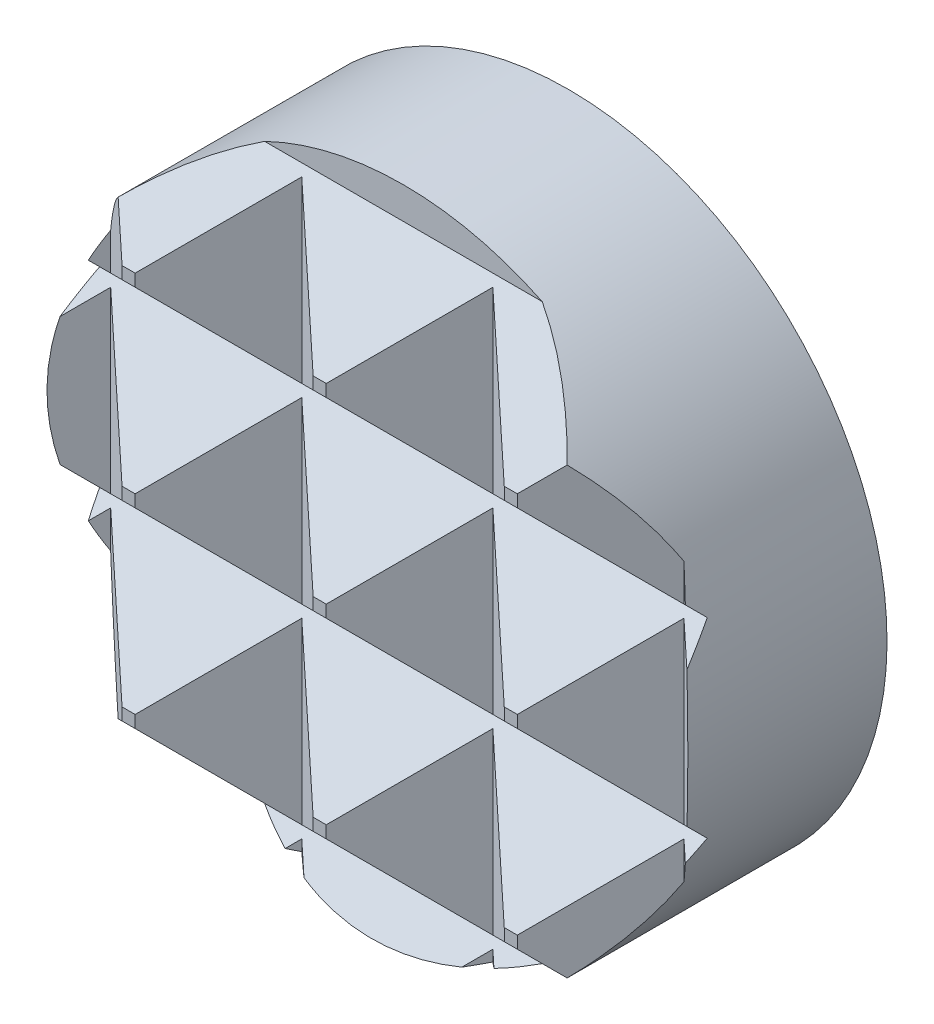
ISO-10303-21;
HEADER;
FILE_DESCRIPTION(('STEP AP214'),'2;1');
FILE_NAME('part.step','',(''),(''),'','','');
FILE_SCHEMA(('AUTOMOTIVE_DESIGN { 1 0 10303 214 1 1 1 1 }'));
ENDSEC;
DATA;
#1=APPLICATION_CONTEXT('core data for automotive mechanical design processes');
#2=APPLICATION_PROTOCOL_DEFINITION('international standard','automotive_design',2000,#1);
#3=PRODUCT_CONTEXT('',#1,'mechanical');
#4=PRODUCT('Part','Part','',(#3));
#5=PRODUCT_RELATED_PRODUCT_CATEGORY('part','',(#4));
#6=PRODUCT_DEFINITION_FORMATION('','',#4);
#7=PRODUCT_DEFINITION_CONTEXT('part definition',#1,'design');
#8=PRODUCT_DEFINITION('design','',#6,#7);
#9=PRODUCT_DEFINITION_SHAPE('','',#8);
#10=(LENGTH_UNIT() NAMED_UNIT(*) SI_UNIT(.MILLI.,.METRE.));
#11=(NAMED_UNIT(*) PLANE_ANGLE_UNIT() SI_UNIT($,.RADIAN.));
#12=(NAMED_UNIT(*) SI_UNIT($,.STERADIAN.) SOLID_ANGLE_UNIT());
#13=UNCERTAINTY_MEASURE_WITH_UNIT(LENGTH_MEASURE(1.E-05),#10,'distance_accuracy_value','');
#14=(GEOMETRIC_REPRESENTATION_CONTEXT(3) GLOBAL_UNCERTAINTY_ASSIGNED_CONTEXT((#13)) GLOBAL_UNIT_ASSIGNED_CONTEXT((#10,
#11,#12)) REPRESENTATION_CONTEXT('',''));
#15=CARTESIAN_POINT('',(0.,0.,0.));
#16=DIRECTION('',(0.,0.,1.));
#17=DIRECTION('',(1.,0.,0.));
#18=AXIS2_PLACEMENT_3D('',#15,#16,#17);
#19=CARTESIAN_POINT('',(3.96975,2.45745,3.679825));
#20=DIRECTION('',(0.,0.,-1.));
#21=DIRECTION('',(-1.,0.,0.));
#22=AXIS2_PLACEMENT_3D('',#19,#20,#21);
#23=PLANE('',#22);
#24=DIRECTION('',(-1.,0.,0.));
#25=VECTOR('',#24,1.);
#26=CARTESIAN_POINT('',(3.96975,2.30505,3.679825));
#27=LINE('',#26,#25);
#28=CARTESIAN_POINT('',(2.53365,2.30505,3.679825));
#29=VERTEX_POINT('',#28);
#30=CARTESIAN_POINT('',(2.37082948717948,2.30505,3.679825));
#31=VERTEX_POINT('',#30);
#32=EDGE_CURVE('E558',#29,#31,#27,.T.);
#33=ORIENTED_EDGE('',*,*,#32,.F.);
#34=DIRECTION('',(0.,1.,0.));
#35=VECTOR('',#34,1.);
#36=CARTESIAN_POINT('',(2.53365,2.45745,3.679825));
#37=LINE('',#36,#35);
#38=CARTESIAN_POINT('',(2.53365,2.45745,3.679825));
#39=VERTEX_POINT('',#38);
#40=EDGE_CURVE('E29',#29,#39,#37,.T.);
#41=ORIENTED_EDGE('',*,*,#40,.T.);
#42=DIRECTION('',(-1.,0.,0.));
#43=VECTOR('',#42,1.);
#44=CARTESIAN_POINT('',(3.96975,2.45745,3.679825));
#45=LINE('',#44,#43);
#46=CARTESIAN_POINT('',(2.37082948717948,2.45745,3.679825));
#47=VERTEX_POINT('',#46);
#48=EDGE_CURVE('E553',#39,#47,#45,.T.);
#49=ORIENTED_EDGE('',*,*,#48,.T.);
#50=DIRECTION('',(0.,-1.,0.));
#51=VECTOR('',#50,1.);
#52=CARTESIAN_POINT('',(2.37082948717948,2.45745,3.679825));
#53=LINE('',#52,#51);
#54=EDGE_CURVE('E395',#47,#31,#53,.T.);
#55=ORIENTED_EDGE('',*,*,#54,.T.);
#56=EDGE_LOOP('',(#33,#41,#49,#55));
#57=FACE_BOUND('',#56,.T.);
#58=ADVANCED_FACE('F14',(#57),#23,.F.);
#59=CARTESIAN_POINT('',(3.969775,0.0761999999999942,3.679825));
#60=DIRECTION('',(0.,0.,-1.));
#61=DIRECTION('',(-1.,0.,0.));
#62=AXIS2_PLACEMENT_3D('',#59,#60,#61);
#63=PLANE('',#62);
#64=DIRECTION('',(-1.,0.,0.));
#65=VECTOR('',#64,1.);
#66=CARTESIAN_POINT('',(3.969775,-0.0761999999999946,3.679825));
#67=LINE('',#66,#65);
#68=CARTESIAN_POINT('',(2.53365,-0.0761999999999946,3.679825));
#69=VERTEX_POINT('',#68);
#70=CARTESIAN_POINT('',(2.37082948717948,-0.0761999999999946,3.679825));
#71=VERTEX_POINT('',#70);
#72=EDGE_CURVE('E547',#69,#71,#67,.T.);
#73=ORIENTED_EDGE('',*,*,#72,.F.);
#74=DIRECTION('',(0.,1.,0.));
#75=VECTOR('',#74,1.);
#76=CARTESIAN_POINT('',(2.53365,0.0761999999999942,3.679825));
#77=LINE('',#76,#75);
#78=CARTESIAN_POINT('',(2.53365,0.0761999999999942,3.679825));
#79=VERTEX_POINT('',#78);
#80=EDGE_CURVE('E37',#69,#79,#77,.T.);
#81=ORIENTED_EDGE('',*,*,#80,.T.);
#82=DIRECTION('',(-1.,0.,0.));
#83=VECTOR('',#82,1.);
#84=CARTESIAN_POINT('',(3.969775,0.0761999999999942,3.679825));
#85=LINE('',#84,#83);
#86=CARTESIAN_POINT('',(2.37082948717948,0.0761999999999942,3.679825));
#87=VERTEX_POINT('',#86);
#88=EDGE_CURVE('E542',#79,#87,#85,.T.);
#89=ORIENTED_EDGE('',*,*,#88,.T.);
#90=DIRECTION('',(0.,-1.,0.));
#91=VECTOR('',#90,1.);
#92=CARTESIAN_POINT('',(2.37082948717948,0.0761999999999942,3.679825));
#93=LINE('',#92,#91);
#94=EDGE_CURVE('E386',#87,#71,#93,.T.);
#95=ORIENTED_EDGE('',*,*,#94,.T.);
#96=EDGE_LOOP('',(#73,#81,#89,#95));
#97=FACE_BOUND('',#96,.T.);
#98=ADVANCED_FACE('F704',(#97),#63,.F.);
#99=CARTESIAN_POINT('',(3.969775,-2.30505,3.679825));
#100=DIRECTION('',(0.,0.,-1.));
#101=DIRECTION('',(-1.,0.,0.));
#102=AXIS2_PLACEMENT_3D('',#99,#100,#101);
#103=PLANE('',#102);
#104=DIRECTION('',(-1.,0.,0.));
#105=VECTOR('',#104,1.);
#106=CARTESIAN_POINT('',(3.969775,-2.45745,3.679825));
#107=LINE('',#106,#105);
#108=CARTESIAN_POINT('',(2.53365,-2.45745,3.679825));
#109=VERTEX_POINT('',#108);
#110=CARTESIAN_POINT('',(2.37082948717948,-2.45745,3.679825));
#111=VERTEX_POINT('',#110);
#112=EDGE_CURVE('E521',#109,#111,#107,.T.);
#113=ORIENTED_EDGE('',*,*,#112,.F.);
#114=DIRECTION('',(0.,1.,0.));
#115=VECTOR('',#114,1.);
#116=CARTESIAN_POINT('',(2.53365,-2.30505,3.679825));
#117=LINE('',#116,#115);
#118=CARTESIAN_POINT('',(2.53365,-2.30505,3.679825));
#119=VERTEX_POINT('',#118);
#120=EDGE_CURVE('E304',#109,#119,#117,.T.);
#121=ORIENTED_EDGE('',*,*,#120,.T.);
#122=DIRECTION('',(-1.,0.,0.));
#123=VECTOR('',#122,1.);
#124=CARTESIAN_POINT('',(3.969775,-2.30505,3.679825));
#125=LINE('',#124,#123);
#126=CARTESIAN_POINT('',(2.37082948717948,-2.30505,3.679825));
#127=VERTEX_POINT('',#126);
#128=EDGE_CURVE('E525',#119,#127,#125,.T.);
#129=ORIENTED_EDGE('',*,*,#128,.T.);
#130=DIRECTION('',(0.,-1.,0.));
#131=VECTOR('',#130,1.);
#132=CARTESIAN_POINT('',(2.37082948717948,-2.30505,3.679825));
#133=LINE('',#132,#131);
#134=EDGE_CURVE('E377',#127,#111,#133,.T.);
#135=ORIENTED_EDGE('',*,*,#134,.T.);
#136=EDGE_LOOP('',(#113,#121,#129,#135));
#137=FACE_BOUND('',#136,.T.);
#138=ADVANCED_FACE('F614',(#137),#103,.F.);
#139=CARTESIAN_POINT('',(0.1524,2.30505,3.679825));
#140=VERTEX_POINT('',#139);
#141=CARTESIAN_POINT('',(-0.0104205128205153,2.30505,3.679825));
#142=VERTEX_POINT('',#141);
#143=EDGE_CURVE('E561',#140,#142,#27,.T.);
#144=ORIENTED_EDGE('',*,*,#143,.F.);
#145=DIRECTION('',(0.,1.,0.));
#146=VECTOR('',#145,1.);
#147=CARTESIAN_POINT('',(0.1524,2.45745,3.679825));
#148=LINE('',#147,#146);
#149=CARTESIAN_POINT('',(0.1524,2.45745,3.679825));
#150=VERTEX_POINT('',#149);
#151=EDGE_CURVE('E366',#140,#150,#148,.T.);
#152=ORIENTED_EDGE('',*,*,#151,.T.);
#153=CARTESIAN_POINT('',(-0.010420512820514,2.45745,3.679825));
#154=VERTEX_POINT('',#153);
#155=EDGE_CURVE('E556',#150,#154,#45,.T.);
#156=ORIENTED_EDGE('',*,*,#155,.T.);
#157=DIRECTION('',(0.,-1.,0.));
#158=VECTOR('',#157,1.);
#159=CARTESIAN_POINT('',(-0.010420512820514,2.45745,3.679825));
#160=LINE('',#159,#158);
#161=EDGE_CURVE('E459',#154,#142,#160,.T.);
#162=ORIENTED_EDGE('',*,*,#161,.T.);
#163=EDGE_LOOP('',(#144,#152,#156,#162));
#164=FACE_BOUND('',#163,.T.);
#165=ADVANCED_FACE('F717',(#164),#23,.F.);
#166=CARTESIAN_POINT('',(0.1524,-0.0761999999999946,3.679825));
#167=VERTEX_POINT('',#166);
#168=CARTESIAN_POINT('',(-0.0104205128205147,-0.0761999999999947,3.679825));
#169=VERTEX_POINT('',#168);
#170=EDGE_CURVE('E549',#167,#169,#67,.T.);
#171=ORIENTED_EDGE('',*,*,#170,.F.);
#172=DIRECTION('',(0.,1.,0.));
#173=VECTOR('',#172,1.);
#174=CARTESIAN_POINT('',(0.1524,0.0761999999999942,3.679825));
#175=LINE('',#174,#173);
#176=CARTESIAN_POINT('',(0.1524,0.0761999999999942,3.679825));
#177=VERTEX_POINT('',#176);
#178=EDGE_CURVE('E357',#167,#177,#175,.T.);
#179=ORIENTED_EDGE('',*,*,#178,.T.);
#180=CARTESIAN_POINT('',(-0.0104205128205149,0.0761999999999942,3.679825));
#181=VERTEX_POINT('',#180);
#182=EDGE_CURVE('E545',#177,#181,#85,.T.);
#183=ORIENTED_EDGE('',*,*,#182,.T.);
#184=DIRECTION('',(0.,-1.,0.));
#185=VECTOR('',#184,1.);
#186=CARTESIAN_POINT('',(-0.0104205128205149,0.0761999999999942,3.679825));
#187=LINE('',#186,#185);
#188=EDGE_CURVE('E450',#181,#169,#187,.T.);
#189=ORIENTED_EDGE('',*,*,#188,.T.);
#190=EDGE_LOOP('',(#171,#179,#183,#189));
#191=FACE_BOUND('',#190,.T.);
#192=ADVANCED_FACE('F693',(#191),#63,.F.);
#193=CARTESIAN_POINT('',(0.1524,-2.45745,3.679825));
#194=VERTEX_POINT('',#193);
#195=CARTESIAN_POINT('',(-0.0104205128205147,-2.45745,3.679825));
#196=VERTEX_POINT('',#195);
#197=EDGE_CURVE('E524',#194,#196,#107,.T.);
#198=ORIENTED_EDGE('',*,*,#197,.F.);
#199=DIRECTION('',(0.,1.,0.));
#200=VECTOR('',#199,1.);
#201=CARTESIAN_POINT('',(0.1524,-2.30505,3.679825));
#202=LINE('',#201,#200);
#203=CARTESIAN_POINT('',(0.1524,-2.30505,3.679825));
#204=VERTEX_POINT('',#203);
#205=EDGE_CURVE('E348',#194,#204,#202,.T.);
#206=ORIENTED_EDGE('',*,*,#205,.T.);
#207=CARTESIAN_POINT('',(-0.0104205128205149,-2.30505,3.679825));
#208=VERTEX_POINT('',#207);
#209=EDGE_CURVE('E527',#204,#208,#125,.T.);
#210=ORIENTED_EDGE('',*,*,#209,.T.);
#211=DIRECTION('',(0.,-1.,0.));
#212=VECTOR('',#211,1.);
#213=CARTESIAN_POINT('',(-0.0104205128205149,-2.30505,3.679825));
#214=LINE('',#213,#212);
#215=EDGE_CURVE('E441',#208,#196,#214,.T.);
#216=ORIENTED_EDGE('',*,*,#215,.T.);
#217=EDGE_LOOP('',(#198,#206,#210,#216));
#218=FACE_BOUND('',#217,.T.);
#219=ADVANCED_FACE('F629',(#218),#103,.F.);
#220=CARTESIAN_POINT('',(0.,0.,0.));
#221=DIRECTION('',(0.,0.,1.));
#222=DIRECTION('',(1.,0.,0.));
#223=AXIS2_PLACEMENT_3D('',#220,#221,#222);
#224=CYLINDRICAL_SURFACE('',#223,3.96875);
#225=CARTESIAN_POINT('',(0.,0.,-0.5005757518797));
#226=DIRECTION('',(0.660500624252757,0.,-0.750825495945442));
#227=DIRECTION('',(0.750825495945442,0.,0.660500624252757));
#228=AXIS2_PLACEMENT_3D('',#225,#226,#227);
#229=ELLIPSE('',#228,5.28584873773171,3.96875);
#230=CARTESIAN_POINT('',(3.87765746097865,-0.845428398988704,2.91059660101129));
#231=VERTEX_POINT('',#230);
#232=CARTESIAN_POINT('',(3.87765746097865,0.845428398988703,2.91059660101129));
#233=VERTEX_POINT('',#232);
#234=EDGE_CURVE('E321',#231,#233,#229,.F.);
#235=ORIENTED_EDGE('',*,*,#234,.F.);
#236=CARTESIAN_POINT('',(0.,0.,3.756025));
#237=DIRECTION('',(0.,0.707106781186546,-0.70710678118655));
#238=DIRECTION('',(0.,0.70710678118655,0.707106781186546));
#239=AXIS2_PLACEMENT_3D('',#236,#237,#238);
#240=ELLIPSE('',#239,5.61266007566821,3.96875);
#241=CARTESIAN_POINT('',(3.78594620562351,-1.190625,2.5654));
#242=VERTEX_POINT('',#241);
#243=EDGE_CURVE('E538',#231,#242,#240,.T.);
#244=ORIENTED_EDGE('',*,*,#243,.T.);
#245=CARTESIAN_POINT('',(0.,0.,1.374775));
#246=DIRECTION('',(0.,-0.707106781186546,-0.70710678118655));
#247=DIRECTION('',(0.,-0.70710678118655,0.707106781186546));
#248=AXIS2_PLACEMENT_3D('',#245,#246,#247);
#249=ELLIPSE('',#248,5.61266007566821,3.96875);
#250=CARTESIAN_POINT('',(3.71601690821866,-1.39362652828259,2.76840152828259));
#251=VERTEX_POINT('',#250);
#252=EDGE_CURVE('E317',#242,#251,#249,.T.);
#253=ORIENTED_EDGE('',*,*,#252,.T.);
#254=CARTESIAN_POINT('',(3.571875,-1.7299380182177,2.6416));
#255=VERTEX_POINT('',#254);
#256=EDGE_CURVE('E309',#255,#251,#229,.F.);
#257=ORIENTED_EDGE('',*,*,#256,.F.);
#258=CARTESIAN_POINT('',(0.,0.,6.213475));
#259=DIRECTION('',(-0.707106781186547,0.,-0.707106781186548));
#260=DIRECTION('',(-0.707106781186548,0.,0.707106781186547));
#261=AXIS2_PLACEMENT_3D('',#258,#259,#260);
#262=ELLIPSE('',#261,5.61266007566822,3.96875);
#263=CARTESIAN_POINT('',(2.844171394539,-2.76797139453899,3.369303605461));
#264=VERTEX_POINT('',#263);
#265=EDGE_CURVE('E295',#264,#255,#262,.F.);
#266=ORIENTED_EDGE('',*,*,#265,.F.);
#267=CARTESIAN_POINT('',(0.,0.,6.137275));
#268=DIRECTION('',(0.,0.707106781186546,-0.70710678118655));
#269=DIRECTION('',(0.,0.70710678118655,0.707106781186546));
#270=AXIS2_PLACEMENT_3D('',#267,#268,#269);
#271=ELLIPSE('',#270,5.61266007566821,3.96875);
#272=CARTESIAN_POINT('',(1.72993801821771,-3.571875,2.5654));
#273=VERTEX_POINT('',#272);
#274=EDGE_CURVE('E528',#264,#273,#271,.T.);
#275=ORIENTED_EDGE('',*,*,#274,.T.);
#276=CARTESIAN_POINT('',(0.,0.,-1.006475));
#277=DIRECTION('',(0.,-0.707106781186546,-0.70710678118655));
#278=DIRECTION('',(0.,-0.70710678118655,0.707106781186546));
#279=AXIS2_PLACEMENT_3D('',#276,#277,#278);
#280=ELLIPSE('',#279,5.6126600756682,3.96875);
#281=CARTESIAN_POINT('',(1.30448615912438,-3.74823857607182,2.74176357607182));
#282=VERTEX_POINT('',#281);
#283=EDGE_CURVE('E510',#273,#282,#280,.T.);
#284=ORIENTED_EDGE('',*,*,#283,.T.);
#285=CARTESIAN_POINT('',(0.,0.,1.59420808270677));
#286=DIRECTION('',(0.660500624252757,0.,-0.750825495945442));
#287=DIRECTION('',(0.750825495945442,0.,0.660500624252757));
#288=AXIS2_PLACEMENT_3D('',#285,#286,#287);
#289=ELLIPSE('',#288,5.28584873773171,3.96875);
#290=CARTESIAN_POINT('',(1.190625,-3.78594620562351,2.6416));
#291=VERTEX_POINT('',#290);
#292=EDGE_CURVE('E372',#291,#282,#289,.F.);
#293=ORIENTED_EDGE('',*,*,#292,.F.);
#294=CARTESIAN_POINT('',(0.,0.,3.832225));
#295=DIRECTION('',(-0.707106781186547,0.,-0.707106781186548));
#296=DIRECTION('',(-0.707106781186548,0.,0.707106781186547));
#297=AXIS2_PLACEMENT_3D('',#294,#295,#296);
#298=ELLIPSE('',#297,5.61266007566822,3.96875);
#299=CARTESIAN_POINT('',(0.997297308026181,-3.84140269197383,2.83492769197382));
#300=VERTEX_POINT('',#299);
#301=EDGE_CURVE('E343',#300,#291,#298,.F.);
#302=ORIENTED_EDGE('',*,*,#301,.F.);
#303=CARTESIAN_POINT('',(-0.9600994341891,-3.85086816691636,2.84439316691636));
#304=VERTEX_POINT('',#303);
#305=EDGE_CURVE('E514',#300,#304,#280,.T.);
#306=ORIENTED_EDGE('',*,*,#305,.T.);
#307=CARTESIAN_POINT('',(0.,0.,3.68899191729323));
#308=DIRECTION('',(0.660500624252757,0.,-0.750825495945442));
#309=DIRECTION('',(0.750825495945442,0.,0.660500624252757));
#310=AXIS2_PLACEMENT_3D('',#307,#308,#309);
#311=ELLIPSE('',#310,5.28584873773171,3.96875);
#312=CARTESIAN_POINT('',(-1.190625,-3.78594620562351,2.6416));
#313=VERTEX_POINT('',#312);
#314=EDGE_CURVE('E435',#313,#304,#311,.F.);
#315=ORIENTED_EDGE('',*,*,#314,.F.);
#316=CARTESIAN_POINT('',(0.,0.,1.450975));
#317=DIRECTION('',(-0.707106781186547,0.,-0.707106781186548));
#318=DIRECTION('',(-0.707106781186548,0.,0.707106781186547));
#319=AXIS2_PLACEMENT_3D('',#316,#317,#318);
#320=ELLIPSE('',#319,5.61266007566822,3.96875);
#321=CARTESIAN_POINT('',(-1.29431347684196,-3.75176347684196,2.74528847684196));
#322=VERTEX_POINT('',#321);
#323=EDGE_CURVE('E406',#322,#313,#320,.F.);
#324=ORIENTED_EDGE('',*,*,#323,.F.);
#325=CARTESIAN_POINT('',(-1.72993801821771,-3.571875,2.5654));
#326=VERTEX_POINT('',#325);
#327=EDGE_CURVE('E515',#322,#326,#280,.T.);
#328=ORIENTED_EDGE('',*,*,#327,.T.);
#329=CARTESIAN_POINT('',(0.,0.,6.137275));
#330=DIRECTION('',(0.,-0.707106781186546,0.70710678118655));
#331=DIRECTION('',(0.,0.70710678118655,0.707106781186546));
#332=AXIS2_PLACEMENT_3D('',#329,#330,#331);
#333=ELLIPSE('',#332,5.61266007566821,3.96875);
#334=CARTESIAN_POINT('',(-2.79786000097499,-2.81477458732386,3.32250041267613));
#335=VERTEX_POINT('',#334);
#336=EDGE_CURVE('E523',#335,#326,#333,.T.);
#337=ORIENTED_EDGE('',*,*,#336,.F.);
#338=CARTESIAN_POINT('',(0.,0.,5.7837757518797));
#339=DIRECTION('',(0.660500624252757,0.,-0.750825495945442));
#340=DIRECTION('',(0.750825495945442,0.,0.660500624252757));
#341=AXIS2_PLACEMENT_3D('',#338,#339,#340);
#342=ELLIPSE('',#341,5.28584873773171,3.96875);
#343=CARTESIAN_POINT('',(-3.571875,-1.72993801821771,2.6416));
#344=VERTEX_POINT('',#343);
#345=EDGE_CURVE('E473',#344,#335,#342,.F.);
#346=ORIENTED_EDGE('',*,*,#345,.F.);
#347=CARTESIAN_POINT('',(0.,0.,-0.930275));
#348=DIRECTION('',(-0.707106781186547,0.,-0.707106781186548));
#349=DIRECTION('',(-0.707106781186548,0.,0.707106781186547));
#350=AXIS2_PLACEMENT_3D('',#347,#348,#349);
#351=ELLIPSE('',#350,5.61266007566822,3.96875);
#352=CARTESIAN_POINT('',(-3.7112696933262,-1.4062196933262,2.7809946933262));
#353=VERTEX_POINT('',#352);
#354=EDGE_CURVE('E497',#353,#344,#351,.F.);
#355=ORIENTED_EDGE('',*,*,#354,.F.);
#356=CARTESIAN_POINT('',(0.,0.,1.374775));
#357=DIRECTION('',(0.,0.707106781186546,0.70710678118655));
#358=DIRECTION('',(0.,-0.70710678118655,0.707106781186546));
#359=AXIS2_PLACEMENT_3D('',#356,#357,#358);
#360=ELLIPSE('',#359,5.61266007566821,3.96875);
#361=CARTESIAN_POINT('',(-3.78594620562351,-1.190625,2.5654));
#362=VERTEX_POINT('',#361);
#363=EDGE_CURVE('E520',#362,#353,#360,.T.);
#364=ORIENTED_EDGE('',*,*,#363,.F.);
#365=CARTESIAN_POINT('',(0.,0.,3.756025));
#366=DIRECTION('',(0.,-0.707106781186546,0.70710678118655));
#367=DIRECTION('',(0.,0.70710678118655,0.707106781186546));
#368=AXIS2_PLACEMENT_3D('',#365,#366,#367);
#369=ELLIPSE('',#368,5.61266007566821,3.96875);
#370=CARTESIAN_POINT('',(-3.88753866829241,-0.798761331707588,2.95726366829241));
#371=VERTEX_POINT('',#370);
#372=EDGE_CURVE('E530',#371,#362,#369,.T.);
#373=ORIENTED_EDGE('',*,*,#372,.F.);
#374=CARTESIAN_POINT('',(-3.88753866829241,0.798761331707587,2.95726366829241));
#375=VERTEX_POINT('',#374);
#376=EDGE_CURVE('E501',#375,#371,#351,.F.);
#377=ORIENTED_EDGE('',*,*,#376,.F.);
#378=CARTESIAN_POINT('',(0.,0.,3.756025));
#379=DIRECTION('',(0.,0.707106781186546,0.70710678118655));
#380=DIRECTION('',(0.,-0.70710678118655,0.707106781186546));
#381=AXIS2_PLACEMENT_3D('',#378,#379,#380);
#382=ELLIPSE('',#381,5.61266007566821,3.96875);
#383=CARTESIAN_POINT('',(-3.78594620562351,1.190625,2.5654));
#384=VERTEX_POINT('',#383);
#385=EDGE_CURVE('E537',#384,#375,#382,.T.);
#386=ORIENTED_EDGE('',*,*,#385,.F.);
#387=CARTESIAN_POINT('',(0.,0.,1.374775));
#388=DIRECTION('',(0.,-0.707106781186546,0.707106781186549));
#389=DIRECTION('',(0.,0.70710678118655,0.707106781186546));
#390=AXIS2_PLACEMENT_3D('',#387,#388,#389);
#391=ELLIPSE('',#390,5.61266007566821,3.96875);
#392=CARTESIAN_POINT('',(-3.7112696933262,1.4062196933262,2.78099469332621));
#393=VERTEX_POINT('',#392);
#394=EDGE_CURVE('E540',#393,#384,#391,.T.);
#395=ORIENTED_EDGE('',*,*,#394,.F.);
#396=CARTESIAN_POINT('',(-3.571875,1.72993801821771,2.6416));
#397=VERTEX_POINT('',#396);
#398=EDGE_CURVE('E500',#397,#393,#351,.F.);
#399=ORIENTED_EDGE('',*,*,#398,.F.);
#400=CARTESIAN_POINT('',(-2.79786000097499,2.81477458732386,3.32250041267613));
#401=VERTEX_POINT('',#400);
#402=EDGE_CURVE('E476',#401,#397,#342,.F.);
#403=ORIENTED_EDGE('',*,*,#402,.F.);
#404=CARTESIAN_POINT('',(0.,0.,6.137275));
#405=DIRECTION('',(0.,0.707106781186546,0.70710678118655));
#406=DIRECTION('',(0.,-0.70710678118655,0.707106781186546));
#407=AXIS2_PLACEMENT_3D('',#404,#405,#406);
#408=ELLIPSE('',#407,5.61266007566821,3.96875);
#409=CARTESIAN_POINT('',(-1.72993801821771,3.571875,2.5654));
#410=VERTEX_POINT('',#409);
#411=EDGE_CURVE('E581',#410,#401,#408,.T.);
#412=ORIENTED_EDGE('',*,*,#411,.F.);
#413=CARTESIAN_POINT('',(0.,0.,2.5654));
#414=DIRECTION('',(0.,0.,1.));
#415=DIRECTION('',(1.,0.,0.));
#416=AXIS2_PLACEMENT_3D('',#413,#414,#415);
#417=CIRCLE('',#416,3.96875);
#418=CARTESIAN_POINT('',(1.72993801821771,3.571875,2.5654));
#419=VERTEX_POINT('',#418);
#420=EDGE_CURVE('E575',#419,#410,#417,.T.);
#421=ORIENTED_EDGE('',*,*,#420,.F.);
#422=CARTESIAN_POINT('',(0.,0.,6.137275));
#423=DIRECTION('',(0.,-0.707106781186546,-0.70710678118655));
#424=DIRECTION('',(0.,-0.70710678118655,0.707106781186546));
#425=AXIS2_PLACEMENT_3D('',#422,#423,#424);
#426=ELLIPSE('',#425,5.61266007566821,3.96875);
#427=CARTESIAN_POINT('',(2.844171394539,2.76797139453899,3.369303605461));
#428=VERTEX_POINT('',#427);
#429=EDGE_CURVE('E565',#419,#428,#426,.T.);
#430=ORIENTED_EDGE('',*,*,#429,.T.);
#431=CARTESIAN_POINT('',(3.571875,1.7299380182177,2.6416));
#432=VERTEX_POINT('',#431);
#433=EDGE_CURVE('E306',#432,#428,#262,.F.);
#434=ORIENTED_EDGE('',*,*,#433,.F.);
#435=CARTESIAN_POINT('',(3.71601690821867,1.39362652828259,2.76840152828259));
#436=VERTEX_POINT('',#435);
#437=EDGE_CURVE('E320',#436,#432,#229,.F.);
#438=ORIENTED_EDGE('',*,*,#437,.F.);
#439=CARTESIAN_POINT('',(0.,0.,1.374775));
#440=DIRECTION('',(0.,0.707106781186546,-0.707106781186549));
#441=DIRECTION('',(0.,0.70710678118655,0.707106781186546));
#442=AXIS2_PLACEMENT_3D('',#439,#440,#441);
#443=ELLIPSE('',#442,5.61266007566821,3.96875);
#444=CARTESIAN_POINT('',(3.78594620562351,1.190625,2.5654));
#445=VERTEX_POINT('',#444);
#446=EDGE_CURVE('E572',#436,#445,#443,.T.);
#447=ORIENTED_EDGE('',*,*,#446,.T.);
#448=CARTESIAN_POINT('',(0.,0.,3.756025));
#449=DIRECTION('',(0.,-0.707106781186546,-0.70710678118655));
#450=DIRECTION('',(0.,-0.70710678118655,0.707106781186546));
#451=AXIS2_PLACEMENT_3D('',#448,#449,#450);
#452=ELLIPSE('',#451,5.61266007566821,3.96875);
#453=EDGE_CURVE('E541',#445,#233,#452,.T.);
#454=ORIENTED_EDGE('',*,*,#453,.T.);
#455=EDGE_LOOP('',(#235,#244,#253,#257,#266,#275,#284,#293,#302,#306,#315,#324,#328,#337,#346,
#355,#364,#373,#377,#386,#395,#399,#403,#412,#421,#430,#434,#438,#447,#454));
#456=FACE_BOUND('',#455,.T.);
#457=CARTESIAN_POINT('',(0.,0.,0.508));
#458=DIRECTION('',(0.,0.,-1.));
#459=DIRECTION('',(-1.,0.,0.));
#460=AXIS2_PLACEMENT_3D('',#457,#458,#459);
#461=CIRCLE('',#460,3.96875);
#462=CARTESIAN_POINT('',(-3.96875,0.,0.508));
#463=VERTEX_POINT('',#462);
#464=EDGE_CURVE('E571',#463,#463,#461,.T.);
#465=ORIENTED_EDGE('',*,*,#464,.F.);
#466=EDGE_LOOP('',(#465));
#467=FACE_BOUND('',#466,.T.);
#468=ADVANCED_FACE('F16',(#456,#467),#224,.T.);
#469=CARTESIAN_POINT('',(0.,0.,2.5654));
#470=DIRECTION('',(0.,0.,1.));
#471=DIRECTION('',(1.,0.,0.));
#472=AXIS2_PLACEMENT_3D('',#469,#470,#471);
#473=PLANE('',#472);
#474=DIRECTION('',(-1.,0.,0.));
#475=VECTOR('',#474,1.);
#476=CARTESIAN_POINT('',(3.96975,3.571875,2.5654));
#477=LINE('',#476,#475);
#478=EDGE_CURVE('E555',#419,#410,#477,.T.);
#479=ORIENTED_EDGE('',*,*,#478,.F.);
#480=ORIENTED_EDGE('',*,*,#420,.T.);
#481=EDGE_LOOP('',(#479,#480));
#482=FACE_BOUND('',#481,.T.);
#483=ADVANCED_FACE('F1083',(#482),#473,.T.);
#484=CARTESIAN_POINT('',(0.,0.,0.508));
#485=DIRECTION('',(0.,0.,-1.));
#486=DIRECTION('',(-1.,0.,0.));
#487=AXIS2_PLACEMENT_3D('',#484,#485,#486);
#488=PLANE('',#487);
#489=CARTESIAN_POINT('',(0.,0.,0.508));
#490=DIRECTION('',(0.,0.,-1.));
#491=DIRECTION('',(-1.,0.,0.));
#492=AXIS2_PLACEMENT_3D('',#489,#490,#491);
#493=CIRCLE('',#492,3.71475);
#494=CARTESIAN_POINT('',(-3.71475,0.,0.508));
#495=VERTEX_POINT('',#494);
#496=EDGE_CURVE('E568',#495,#495,#493,.T.);
#497=ORIENTED_EDGE('',*,*,#496,.F.);
#498=EDGE_LOOP('',(#497));
#499=FACE_BOUND('',#498,.T.);
#500=ORIENTED_EDGE('',*,*,#464,.T.);
#501=EDGE_LOOP('',(#500));
#502=FACE_BOUND('',#501,.T.);
#503=ADVANCED_FACE('F1075',(#499,#502),#488,.T.);
#504=CARTESIAN_POINT('',(0.,0.,0.));
#505=DIRECTION('',(0.,0.,1.));
#506=DIRECTION('',(1.,0.,0.));
#507=AXIS2_PLACEMENT_3D('',#504,#505,#506);
#508=PLANE('',#507);
#509=CARTESIAN_POINT('',(0.,0.,0.));
#510=DIRECTION('',(0.,0.,1.));
#511=DIRECTION('',(1.,0.,0.));
#512=AXIS2_PLACEMENT_3D('',#509,#510,#511);
#513=CIRCLE('',#512,3.20675);
#514=CARTESIAN_POINT('',(3.20675,0.,0.));
#515=VERTEX_POINT('',#514);
#516=EDGE_CURVE('E576',#515,#515,#513,.F.);
#517=ORIENTED_EDGE('',*,*,#516,.T.);
#518=EDGE_LOOP('',(#517));
#519=FACE_BOUND('',#518,.T.);
#520=ADVANCED_FACE('F737',(#519),#508,.F.);
#521=CARTESIAN_POINT('',(0.,0.,0.));
#522=DIRECTION('',(0.,0.,1.));
#523=DIRECTION('',(1.,0.,0.));
#524=AXIS2_PLACEMENT_3D('',#521,#522,#523);
#525=CONICAL_SURFACE('',#524,3.20675,0.785398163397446);
#526=ORIENTED_EDGE('',*,*,#496,.T.);
#527=EDGE_LOOP('',(#526));
#528=FACE_BOUND('',#527,.T.);
#529=ORIENTED_EDGE('',*,*,#516,.F.);
#530=EDGE_LOOP('',(#529));
#531=FACE_BOUND('',#530,.T.);
#532=ADVANCED_FACE('F730',(#528,#531),#525,.T.);
#533=CARTESIAN_POINT('',(-2.22885,2.30505,3.679825));
#534=VERTEX_POINT('',#533);
#535=CARTESIAN_POINT('',(-2.39167051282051,2.30505,3.679825));
#536=VERTEX_POINT('',#535);
#537=EDGE_CURVE('E562',#534,#536,#27,.T.);
#538=ORIENTED_EDGE('',*,*,#537,.F.);
#539=DIRECTION('',(0.,1.,0.));
#540=VECTOR('',#539,1.);
#541=CARTESIAN_POINT('',(-2.22885,2.45745,3.679825));
#542=LINE('',#541,#540);
#543=CARTESIAN_POINT('',(-2.22885,2.45745,3.679825));
#544=VERTEX_POINT('',#543);
#545=EDGE_CURVE('E429',#534,#544,#542,.T.);
#546=ORIENTED_EDGE('',*,*,#545,.T.);
#547=CARTESIAN_POINT('',(-2.39167051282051,2.45745,3.679825));
#548=VERTEX_POINT('',#547);
#549=EDGE_CURVE('E557',#544,#548,#45,.T.);
#550=ORIENTED_EDGE('',*,*,#549,.T.);
#551=DIRECTION('',(0.,-1.,0.));
#552=VECTOR('',#551,1.);
#553=CARTESIAN_POINT('',(-2.39167051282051,2.45745,3.679825));
#554=LINE('',#553,#552);
#555=EDGE_CURVE('E491',#548,#536,#554,.T.);
#556=ORIENTED_EDGE('',*,*,#555,.T.);
#557=EDGE_LOOP('',(#538,#546,#550,#556));
#558=FACE_BOUND('',#557,.T.);
#559=ADVANCED_FACE('F721',(#558),#23,.F.);
#560=CARTESIAN_POINT('',(3.96975,3.571875,2.5654));
#561=DIRECTION('',(0.,-0.707106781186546,-0.70710678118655));
#562=DIRECTION('',(0.,0.70710678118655,-0.707106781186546));
#563=AXIS2_PLACEMENT_3D('',#560,#561,#562);
#564=PLANE('',#563);
#565=ORIENTED_EDGE('',*,*,#48,.F.);
#566=DIRECTION('',(0.577350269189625,0.577350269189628,-0.577350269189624));
#567=VECTOR('',#566,1.);
#568=CARTESIAN_POINT('',(3.7553,3.6791,2.458175));
#569=LINE('',#568,#567);
#570=EDGE_CURVE('E324',#39,#428,#569,.T.);
#571=ORIENTED_EDGE('',*,*,#570,.T.);
#572=ORIENTED_EDGE('',*,*,#429,.F.);
#573=ORIENTED_EDGE('',*,*,#478,.T.);
#574=ORIENTED_EDGE('',*,*,#411,.T.);
#575=DIRECTION('',(0.626501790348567,-0.55113315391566,0.551133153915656));
#576=VECTOR('',#575,1.);
#577=CARTESIAN_POINT('',(-0.664374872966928,0.937949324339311,5.19932567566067));
#578=LINE('',#577,#576);
#579=EDGE_CURVE('E488',#401,#548,#578,.T.);
#580=ORIENTED_EDGE('',*,*,#579,.T.);
#581=ORIENTED_EDGE('',*,*,#549,.F.);
#582=DIRECTION('',(0.577350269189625,0.577350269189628,-0.577350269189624));
#583=VECTOR('',#582,1.);
#584=CARTESIAN_POINT('',(0.5803,5.2666,0.870675));
#585=LINE('',#584,#583);
#586=CARTESIAN_POINT('',(-1.190625,3.495675,2.6416));
#587=VERTEX_POINT('',#586);
#588=EDGE_CURVE('E432',#544,#587,#585,.T.);
#589=ORIENTED_EDGE('',*,*,#588,.T.);
#590=DIRECTION('',(0.626501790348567,-0.55113315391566,0.551133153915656));
#591=VECTOR('',#590,1.);
#592=CARTESIAN_POINT('',(0.782223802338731,1.76016139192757,4.37711360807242));
#593=LINE('',#592,#591);
#594=EDGE_CURVE('E462',#587,#154,#593,.T.);
#595=ORIENTED_EDGE('',*,*,#594,.T.);
#596=ORIENTED_EDGE('',*,*,#155,.F.);
#597=DIRECTION('',(0.577350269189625,0.577350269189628,-0.577350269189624));
#598=VECTOR('',#597,1.);
#599=CARTESIAN_POINT('',(2.1678,4.47285,1.664425));
#600=LINE('',#599,#598);
#601=CARTESIAN_POINT('',(1.190625,3.495675,2.6416));
#602=VERTEX_POINT('',#601);
#603=EDGE_CURVE('E369',#150,#602,#600,.T.);
#604=ORIENTED_EDGE('',*,*,#603,.T.);
#605=DIRECTION('',(0.626501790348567,-0.55113315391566,0.551133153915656));
#606=VECTOR('',#605,1.);
#607=CARTESIAN_POINT('',(2.22882247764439,2.58237345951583,3.55490154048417));
#608=LINE('',#607,#606);
#609=EDGE_CURVE('E398',#602,#47,#608,.T.);
#610=ORIENTED_EDGE('',*,*,#609,.T.);
#611=EDGE_LOOP('',(#565,#571,#572,#573,#574,#580,#581,#589,#595,#596,#604,#610));
#612=FACE_BOUND('',#611,.T.);
#613=ADVANCED_FACE('F711',(#612),#564,.F.);
#614=CARTESIAN_POINT('',(3.96975,1.190625,2.5654));
#615=DIRECTION('',(0.,0.707106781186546,-0.707106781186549));
#616=DIRECTION('',(0.,0.70710678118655,0.707106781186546));
#617=AXIS2_PLACEMENT_3D('',#614,#615,#616);
#618=PLANE('',#617);
#619=ORIENTED_EDGE('',*,*,#446,.F.);
#620=DIRECTION('',(-0.626501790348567,-0.551133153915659,-0.551133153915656));
#621=VECTOR('',#620,1.);
#622=CARTESIAN_POINT('',(3.67542115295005,1.35791447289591,2.73268947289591));
#623=LINE('',#622,#621);
#624=CARTESIAN_POINT('',(3.571875,1.266825,2.6416));
#625=VERTEX_POINT('',#624);
#626=EDGE_CURVE('E327',#436,#625,#623,.T.);
#627=ORIENTED_EDGE('',*,*,#626,.T.);
#628=DIRECTION('',(-0.577350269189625,0.577350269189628,0.577350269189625));
#629=VECTOR('',#628,1.);
#630=CARTESIAN_POINT('',(3.7553,1.0834,2.458175));
#631=LINE('',#630,#629);
#632=EDGE_CURVE('E768',#625,#29,#631,.T.);
#633=ORIENTED_EDGE('',*,*,#632,.T.);
#634=ORIENTED_EDGE('',*,*,#32,.T.);
#635=DIRECTION('',(-0.626501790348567,-0.551133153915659,-0.551133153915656));
#636=VECTOR('',#635,1.);
#637=CARTESIAN_POINT('',(2.22882247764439,2.18012654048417,3.55490154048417));
#638=LINE('',#637,#636);
#639=CARTESIAN_POINT('',(1.190625,1.266825,2.6416));
#640=VERTEX_POINT('',#639);
#641=EDGE_CURVE('E392',#31,#640,#638,.T.);
#642=ORIENTED_EDGE('',*,*,#641,.T.);
#643=DIRECTION('',(-0.577350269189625,0.577350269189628,0.577350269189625));
#644=VECTOR('',#643,1.);
#645=CARTESIAN_POINT('',(2.1678,0.28965,1.664425));
#646=LINE('',#645,#644);
#647=EDGE_CURVE('E363',#640,#140,#646,.T.);
#648=ORIENTED_EDGE('',*,*,#647,.T.);
#649=ORIENTED_EDGE('',*,*,#143,.T.);
#650=DIRECTION('',(-0.626501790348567,-0.551133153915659,-0.551133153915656));
#651=VECTOR('',#650,1.);
#652=CARTESIAN_POINT('',(0.782223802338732,3.00233860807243,4.37711360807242));
#653=LINE('',#652,#651);
#654=CARTESIAN_POINT('',(-1.190625,1.266825,2.6416));
#655=VERTEX_POINT('',#654);
#656=EDGE_CURVE('E456',#142,#655,#653,.T.);
#657=ORIENTED_EDGE('',*,*,#656,.T.);
#658=DIRECTION('',(-0.577350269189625,0.577350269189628,0.577350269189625));
#659=VECTOR('',#658,1.);
#660=CARTESIAN_POINT('',(0.5803,-0.5041,0.870675));
#661=LINE('',#660,#659);
#662=EDGE_CURVE('E426',#655,#534,#661,.T.);
#663=ORIENTED_EDGE('',*,*,#662,.T.);
#664=ORIENTED_EDGE('',*,*,#537,.T.);
#665=DIRECTION('',(-0.626501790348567,-0.551133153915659,-0.551133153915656));
#666=VECTOR('',#665,1.);
#667=CARTESIAN_POINT('',(-0.664374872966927,3.82455067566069,5.19932567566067));
#668=LINE('',#667,#666);
#669=CARTESIAN_POINT('',(-3.571875,1.266825,2.6416));
#670=VERTEX_POINT('',#669);
#671=EDGE_CURVE('E494',#536,#670,#668,.T.);
#672=ORIENTED_EDGE('',*,*,#671,.T.);
#673=DIRECTION('',(-0.577350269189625,0.577350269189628,0.577350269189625));
#674=VECTOR('',#673,1.);
#675=CARTESIAN_POINT('',(-1.0072,-1.29785,0.076925));
#676=LINE('',#675,#674);
#677=EDGE_CURVE('E507',#670,#393,#676,.T.);
#678=ORIENTED_EDGE('',*,*,#677,.T.);
#679=ORIENTED_EDGE('',*,*,#394,.T.);
#680=DIRECTION('',(-1.,0.,0.));
#681=VECTOR('',#680,1.);
#682=CARTESIAN_POINT('',(3.96975,1.190625,2.5654));
#683=LINE('',#682,#681);
#684=EDGE_CURVE('E560',#445,#384,#683,.T.);
#685=ORIENTED_EDGE('',*,*,#684,.F.);
#686=EDGE_LOOP('',(#619,#627,#633,#634,#642,#648,#649,#657,#663,#664,#672,#678,#679,#685));
#687=FACE_BOUND('',#686,.T.);
#688=ADVANCED_FACE('F702',(#687),#618,.F.);
#689=CARTESIAN_POINT('',(-2.22885,-0.0761999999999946,3.679825));
#690=VERTEX_POINT('',#689);
#691=CARTESIAN_POINT('',(-2.39167051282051,-0.0761999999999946,3.679825));
#692=VERTEX_POINT('',#691);
#693=EDGE_CURVE('E550',#690,#692,#67,.T.);
#694=ORIENTED_EDGE('',*,*,#693,.F.);
#695=DIRECTION('',(0.,1.,0.));
#696=VECTOR('',#695,1.);
#697=CARTESIAN_POINT('',(-2.22885,0.0761999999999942,3.679825));
#698=LINE('',#697,#696);
#699=CARTESIAN_POINT('',(-2.22885,0.0761999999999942,3.679825));
#700=VERTEX_POINT('',#699);
#701=EDGE_CURVE('E420',#690,#700,#698,.T.);
#702=ORIENTED_EDGE('',*,*,#701,.T.);
#703=CARTESIAN_POINT('',(-2.39167051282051,0.0761999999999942,3.679825));
#704=VERTEX_POINT('',#703);
#705=EDGE_CURVE('E546',#700,#704,#85,.T.);
#706=ORIENTED_EDGE('',*,*,#705,.T.);
#707=DIRECTION('',(0.,-1.,0.));
#708=VECTOR('',#707,1.);
#709=CARTESIAN_POINT('',(-2.39167051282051,0.0761999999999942,3.679825));
#710=LINE('',#709,#708);
#711=EDGE_CURVE('E482',#704,#692,#710,.T.);
#712=ORIENTED_EDGE('',*,*,#711,.T.);
#713=EDGE_LOOP('',(#694,#702,#706,#712));
#714=FACE_BOUND('',#713,.T.);
#715=ADVANCED_FACE('F700',(#714),#63,.F.);
#716=CARTESIAN_POINT('',(3.969775,1.190625,2.5654));
#717=DIRECTION('',(0.,-0.707106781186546,-0.70710678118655));
#718=DIRECTION('',(0.,0.70710678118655,-0.707106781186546));
#719=AXIS2_PLACEMENT_3D('',#716,#717,#718);
#720=PLANE('',#719);
#721=DIRECTION('',(0.577350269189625,0.577350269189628,-0.577350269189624));
#722=VECTOR('',#721,1.);
#723=CARTESIAN_POINT('',(3.75530833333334,1.29785833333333,2.45816666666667));
#724=LINE('',#723,#722);
#725=CARTESIAN_POINT('',(3.571875,1.114425,2.6416));
#726=VERTEX_POINT('',#725);
#727=EDGE_CURVE('E777',#79,#726,#724,.T.);
#728=ORIENTED_EDGE('',*,*,#727,.T.);
#729=DIRECTION('',(0.626501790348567,-0.55113315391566,0.551133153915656));
#730=VECTOR('',#729,1.);
#731=CARTESIAN_POINT('',(3.67543096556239,1.0233268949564,2.7326981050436));
#732=LINE('',#731,#730);
#733=EDGE_CURVE('E328',#726,#233,#732,.T.);
#734=ORIENTED_EDGE('',*,*,#733,.T.);
#735=ORIENTED_EDGE('',*,*,#453,.F.);
#736=ORIENTED_EDGE('',*,*,#684,.T.);
#737=ORIENTED_EDGE('',*,*,#385,.T.);
#738=DIRECTION('',(0.577350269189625,0.577350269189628,-0.577350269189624));
#739=VECTOR('',#738,1.);
#740=CARTESIAN_POINT('',(-1.00719166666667,3.67910833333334,0.0769166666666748));
#741=LINE('',#740,#739);
#742=CARTESIAN_POINT('',(-3.571875,1.114425,2.6416));
#743=VERTEX_POINT('',#742);
#744=EDGE_CURVE('E504',#375,#743,#741,.T.);
#745=ORIENTED_EDGE('',*,*,#744,.T.);
#746=DIRECTION('',(0.626501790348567,-0.55113315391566,0.551133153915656));
#747=VECTOR('',#746,1.);
#748=CARTESIAN_POINT('',(-0.664365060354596,-1.44330930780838,5.19933430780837));
#749=LINE('',#748,#747);
#750=EDGE_CURVE('E485',#743,#704,#749,.T.);
#751=ORIENTED_EDGE('',*,*,#750,.T.);
#752=ORIENTED_EDGE('',*,*,#705,.F.);
#753=DIRECTION('',(0.577350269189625,0.577350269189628,-0.577350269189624));
#754=VECTOR('',#753,1.);
#755=CARTESIAN_POINT('',(0.58030833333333,2.88535833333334,0.870666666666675));
#756=LINE('',#755,#754);
#757=CARTESIAN_POINT('',(-1.190625,1.114425,2.6416));
#758=VERTEX_POINT('',#757);
#759=EDGE_CURVE('E423',#700,#758,#756,.T.);
#760=ORIENTED_EDGE('',*,*,#759,.T.);
#761=DIRECTION('',(0.626501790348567,-0.55113315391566,0.551133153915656));
#762=VECTOR('',#761,1.);
#763=CARTESIAN_POINT('',(0.782233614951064,-0.621097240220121,4.37712224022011));
#764=LINE('',#763,#762);
#765=EDGE_CURVE('E453',#758,#181,#764,.T.);
#766=ORIENTED_EDGE('',*,*,#765,.T.);
#767=ORIENTED_EDGE('',*,*,#182,.F.);
#768=DIRECTION('',(0.577350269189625,0.577350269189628,-0.577350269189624));
#769=VECTOR('',#768,1.);
#770=CARTESIAN_POINT('',(2.16780833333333,2.09160833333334,1.66441666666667));
#771=LINE('',#770,#769);
#772=CARTESIAN_POINT('',(1.190625,1.114425,2.6416));
#773=VERTEX_POINT('',#772);
#774=EDGE_CURVE('E360',#177,#773,#771,.T.);
#775=ORIENTED_EDGE('',*,*,#774,.T.);
#776=DIRECTION('',(0.626501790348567,-0.55113315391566,0.551133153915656));
#777=VECTOR('',#776,1.);
#778=CARTESIAN_POINT('',(2.22883229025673,0.201114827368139,3.55491017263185));
#779=LINE('',#778,#777);
#780=EDGE_CURVE('E389',#773,#87,#779,.T.);
#781=ORIENTED_EDGE('',*,*,#780,.T.);
#782=ORIENTED_EDGE('',*,*,#88,.F.);
#783=EDGE_LOOP('',(#728,#734,#735,#736,#737,#745,#751,#752,#760,#766,#767,#775,#781,#782));
#784=FACE_BOUND('',#783,.T.);
#785=ADVANCED_FACE('F654',(#784),#720,.F.);
#786=CARTESIAN_POINT('',(3.969775,-1.190625,2.5654));
#787=DIRECTION('',(0.,0.707106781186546,-0.70710678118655));
#788=DIRECTION('',(0.,0.70710678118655,0.707106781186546));
#789=AXIS2_PLACEMENT_3D('',#786,#787,#788);
#790=PLANE('',#789);
#791=ORIENTED_EDGE('',*,*,#243,.F.);
#792=DIRECTION('',(-0.626501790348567,-0.551133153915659,-0.551133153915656));
#793=VECTOR('',#792,1.);
#794=CARTESIAN_POINT('',(3.67543096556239,-1.0233268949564,2.7326981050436));
#795=LINE('',#794,#793);
#796=CARTESIAN_POINT('',(3.571875,-1.114425,2.6416));
#797=VERTEX_POINT('',#796);
#798=EDGE_CURVE('E318',#231,#797,#795,.T.);
#799=ORIENTED_EDGE('',*,*,#798,.T.);
#800=DIRECTION('',(-0.577350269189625,0.577350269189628,0.577350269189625));
#801=VECTOR('',#800,1.);
#802=CARTESIAN_POINT('',(3.75530833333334,-1.29785833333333,2.45816666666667));
#803=LINE('',#802,#801);
#804=EDGE_CURVE('E774',#797,#69,#803,.T.);
#805=ORIENTED_EDGE('',*,*,#804,.T.);
#806=ORIENTED_EDGE('',*,*,#72,.T.);
#807=DIRECTION('',(-0.626501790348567,-0.551133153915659,-0.551133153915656));
#808=VECTOR('',#807,1.);
#809=CARTESIAN_POINT('',(2.22883229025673,-0.201114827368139,3.55491017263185));
#810=LINE('',#809,#808);
#811=CARTESIAN_POINT('',(1.190625,-1.114425,2.6416));
#812=VERTEX_POINT('',#811);
#813=EDGE_CURVE('E383',#71,#812,#810,.T.);
#814=ORIENTED_EDGE('',*,*,#813,.T.);
#815=DIRECTION('',(-0.577350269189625,0.577350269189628,0.577350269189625));
#816=VECTOR('',#815,1.);
#817=CARTESIAN_POINT('',(2.16780833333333,-2.09160833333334,1.66441666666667));
#818=LINE('',#817,#816);
#819=EDGE_CURVE('E354',#812,#167,#818,.T.);
#820=ORIENTED_EDGE('',*,*,#819,.T.);
#821=ORIENTED_EDGE('',*,*,#170,.T.);
#822=DIRECTION('',(-0.626501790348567,-0.551133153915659,-0.551133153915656));
#823=VECTOR('',#822,1.);
#824=CARTESIAN_POINT('',(0.782233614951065,0.62109724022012,4.37712224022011));
#825=LINE('',#824,#823);
#826=CARTESIAN_POINT('',(-1.190625,-1.114425,2.6416));
#827=VERTEX_POINT('',#826);
#828=EDGE_CURVE('E447',#169,#827,#825,.T.);
#829=ORIENTED_EDGE('',*,*,#828,.T.);
#830=DIRECTION('',(-0.577350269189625,0.577350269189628,0.577350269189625));
#831=VECTOR('',#830,1.);
#832=CARTESIAN_POINT('',(0.58030833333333,-2.88535833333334,0.87066666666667));
#833=LINE('',#832,#831);
#834=EDGE_CURVE('E417',#827,#690,#833,.T.);
#835=ORIENTED_EDGE('',*,*,#834,.T.);
#836=ORIENTED_EDGE('',*,*,#693,.T.);
#837=DIRECTION('',(-0.626501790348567,-0.551133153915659,-0.551133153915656));
#838=VECTOR('',#837,1.);
#839=CARTESIAN_POINT('',(-0.664365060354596,1.44330930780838,5.19933430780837));
#840=LINE('',#839,#838);
#841=CARTESIAN_POINT('',(-3.571875,-1.114425,2.6416));
#842=VERTEX_POINT('',#841);
#843=EDGE_CURVE('E479',#692,#842,#840,.T.);
#844=ORIENTED_EDGE('',*,*,#843,.T.);
#845=DIRECTION('',(-0.577350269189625,0.577350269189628,0.577350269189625));
#846=VECTOR('',#845,1.);
#847=CARTESIAN_POINT('',(-1.00719166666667,-3.67910833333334,0.0769166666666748));
#848=LINE('',#847,#846);
#849=EDGE_CURVE('E499',#842,#371,#848,.T.);
#850=ORIENTED_EDGE('',*,*,#849,.T.);
#851=ORIENTED_EDGE('',*,*,#372,.T.);
#852=DIRECTION('',(-1.,0.,0.));
#853=VECTOR('',#852,1.);
#854=CARTESIAN_POINT('',(3.969775,-1.190625,2.5654));
#855=LINE('',#854,#853);
#856=EDGE_CURVE('E544',#242,#362,#855,.T.);
#857=ORIENTED_EDGE('',*,*,#856,.F.);
#858=EDGE_LOOP('',(#791,#799,#805,#806,#814,#820,#821,#829,#835,#836,#844,#850,#851,#857));
#859=FACE_BOUND('',#858,.T.);
#860=ADVANCED_FACE('F697',(#859),#790,.F.);
#861=CARTESIAN_POINT('',(-2.22885,-2.45745,3.679825));
#862=VERTEX_POINT('',#861);
#863=CARTESIAN_POINT('',(-2.39167051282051,-2.45745,3.679825));
#864=VERTEX_POINT('',#863);
#865=EDGE_CURVE('E519',#862,#864,#107,.T.);
#866=ORIENTED_EDGE('',*,*,#865,.F.);
#867=DIRECTION('',(0.,1.,0.));
#868=VECTOR('',#867,1.);
#869=CARTESIAN_POINT('',(-2.22885,-2.30505,3.679825));
#870=LINE('',#869,#868);
#871=CARTESIAN_POINT('',(-2.22885,-2.30505,3.679825));
#872=VERTEX_POINT('',#871);
#873=EDGE_CURVE('E411',#862,#872,#870,.T.);
#874=ORIENTED_EDGE('',*,*,#873,.T.);
#875=CARTESIAN_POINT('',(-2.39167051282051,-2.30505,3.679825));
#876=VERTEX_POINT('',#875);
#877=EDGE_CURVE('E513',#872,#876,#125,.T.);
#878=ORIENTED_EDGE('',*,*,#877,.T.);
#879=DIRECTION('',(0.,-1.,0.));
#880=VECTOR('',#879,1.);
#881=CARTESIAN_POINT('',(-2.39167051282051,-2.30505,3.679825));
#882=LINE('',#881,#880);
#883=EDGE_CURVE('E470',#876,#864,#882,.T.);
#884=ORIENTED_EDGE('',*,*,#883,.T.);
#885=EDGE_LOOP('',(#866,#874,#878,#884));
#886=FACE_BOUND('',#885,.T.);
#887=ADVANCED_FACE('F641',(#886),#103,.F.);
#888=CARTESIAN_POINT('',(3.969775,-1.190625,2.5654));
#889=DIRECTION('',(0.,-0.707106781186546,-0.70710678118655));
#890=DIRECTION('',(0.,0.70710678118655,-0.707106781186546));
#891=AXIS2_PLACEMENT_3D('',#888,#889,#890);
#892=PLANE('',#891);
#893=DIRECTION('',(0.577350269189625,0.577350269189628,-0.577350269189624));
#894=VECTOR('',#893,1.);
#895=CARTESIAN_POINT('',(3.75530833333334,-1.08339166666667,2.45816666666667));
#896=LINE('',#895,#894);
#897=CARTESIAN_POINT('',(3.571875,-1.266825,2.6416));
#898=VERTEX_POINT('',#897);
#899=EDGE_CURVE('E772',#119,#898,#896,.T.);
#900=ORIENTED_EDGE('',*,*,#899,.T.);
#901=DIRECTION('',(0.626501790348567,-0.55113315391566,0.551133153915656));
#902=VECTOR('',#901,1.);
#903=CARTESIAN_POINT('',(3.67543096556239,-1.3579231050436,2.7326981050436));
#904=LINE('',#903,#902);
#905=EDGE_CURVE('E9',#898,#251,#904,.T.);
#906=ORIENTED_EDGE('',*,*,#905,.T.);
#907=ORIENTED_EDGE('',*,*,#252,.F.);
#908=ORIENTED_EDGE('',*,*,#856,.T.);
#909=ORIENTED_EDGE('',*,*,#363,.T.);
#910=DIRECTION('',(0.577350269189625,0.577350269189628,-0.577350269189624));
#911=VECTOR('',#910,1.);
#912=CARTESIAN_POINT('',(-1.00719166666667,1.29785833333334,0.0769166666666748));
#913=LINE('',#912,#911);
#914=CARTESIAN_POINT('',(-3.571875,-1.266825,2.6416));
#915=VERTEX_POINT('',#914);
#916=EDGE_CURVE('E593',#353,#915,#913,.T.);
#917=ORIENTED_EDGE('',*,*,#916,.T.);
#918=DIRECTION('',(0.626501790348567,-0.55113315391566,0.551133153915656));
#919=VECTOR('',#918,1.);
#920=CARTESIAN_POINT('',(-0.664365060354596,-3.82455930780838,5.19933430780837));
#921=LINE('',#920,#919);
#922=EDGE_CURVE('E475',#915,#876,#921,.T.);
#923=ORIENTED_EDGE('',*,*,#922,.T.);
#924=ORIENTED_EDGE('',*,*,#877,.F.);
#925=DIRECTION('',(0.577350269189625,0.577350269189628,-0.577350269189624));
#926=VECTOR('',#925,1.);
#927=CARTESIAN_POINT('',(0.58030833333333,0.504108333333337,0.870666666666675));
#928=LINE('',#927,#926);
#929=CARTESIAN_POINT('',(-1.190625,-1.266825,2.6416));
#930=VERTEX_POINT('',#929);
#931=EDGE_CURVE('E414',#872,#930,#928,.T.);
#932=ORIENTED_EDGE('',*,*,#931,.T.);
#933=DIRECTION('',(0.626501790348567,-0.55113315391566,0.551133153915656));
#934=VECTOR('',#933,1.);
#935=CARTESIAN_POINT('',(0.782233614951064,-3.00234724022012,4.37712224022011));
#936=LINE('',#935,#934);
#937=EDGE_CURVE('E444',#930,#208,#936,.T.);
#938=ORIENTED_EDGE('',*,*,#937,.T.);
#939=ORIENTED_EDGE('',*,*,#209,.F.);
#940=DIRECTION('',(0.577350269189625,0.577350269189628,-0.577350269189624));
#941=VECTOR('',#940,1.);
#942=CARTESIAN_POINT('',(2.16780833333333,-0.289641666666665,1.66441666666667));
#943=LINE('',#942,#941);
#944=CARTESIAN_POINT('',(1.190625,-1.266825,2.6416));
#945=VERTEX_POINT('',#944);
#946=EDGE_CURVE('E351',#204,#945,#943,.T.);
#947=ORIENTED_EDGE('',*,*,#946,.T.);
#948=DIRECTION('',(0.626501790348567,-0.55113315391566,0.551133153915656));
#949=VECTOR('',#948,1.);
#950=CARTESIAN_POINT('',(2.22883229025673,-2.18013517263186,3.55491017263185));
#951=LINE('',#950,#949);
#952=EDGE_CURVE('E380',#945,#127,#951,.T.);
#953=ORIENTED_EDGE('',*,*,#952,.T.);
#954=ORIENTED_EDGE('',*,*,#128,.F.);
#955=EDGE_LOOP('',(#900,#906,#907,#908,#909,#917,#923,#924,#932,#938,#939,#947,#953,#954));
#956=FACE_BOUND('',#955,.T.);
#957=ADVANCED_FACE('F622',(#956),#892,.F.);
#958=CARTESIAN_POINT('',(3.969775,-3.571875,2.5654));
#959=DIRECTION('',(0.,0.707106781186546,-0.70710678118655));
#960=DIRECTION('',(0.,0.70710678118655,0.707106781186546));
#961=AXIS2_PLACEMENT_3D('',#958,#959,#960);
#962=PLANE('',#961);
#963=ORIENTED_EDGE('',*,*,#274,.F.);
#964=DIRECTION('',(-0.577350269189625,0.577350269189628,0.577350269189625));
#965=VECTOR('',#964,1.);
#966=CARTESIAN_POINT('',(3.75530833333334,-3.67910833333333,2.45816666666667));
#967=LINE('',#966,#965);
#968=EDGE_CURVE('E22',#264,#109,#967,.T.);
#969=ORIENTED_EDGE('',*,*,#968,.T.);
#970=ORIENTED_EDGE('',*,*,#112,.T.);
#971=DIRECTION('',(-0.626501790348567,-0.551133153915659,-0.551133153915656));
#972=VECTOR('',#971,1.);
#973=CARTESIAN_POINT('',(2.22883229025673,-2.58236482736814,3.55491017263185));
#974=LINE('',#973,#972);
#975=CARTESIAN_POINT('',(1.190625,-3.495675,2.6416));
#976=VERTEX_POINT('',#975);
#977=EDGE_CURVE('E374',#111,#976,#974,.T.);
#978=ORIENTED_EDGE('',*,*,#977,.T.);
#979=DIRECTION('',(-0.577350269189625,0.577350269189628,0.577350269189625));
#980=VECTOR('',#979,1.);
#981=CARTESIAN_POINT('',(2.16780833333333,-4.47285833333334,1.66441666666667));
#982=LINE('',#981,#980);
#983=EDGE_CURVE('E345',#976,#194,#982,.T.);
#984=ORIENTED_EDGE('',*,*,#983,.T.);
#985=ORIENTED_EDGE('',*,*,#197,.T.);
#986=DIRECTION('',(-0.626501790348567,-0.551133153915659,-0.551133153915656));
#987=VECTOR('',#986,1.);
#988=CARTESIAN_POINT('',(0.782233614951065,-1.76015275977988,4.37712224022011));
#989=LINE('',#988,#987);
#990=CARTESIAN_POINT('',(-1.190625,-3.495675,2.6416));
#991=VERTEX_POINT('',#990);
#992=EDGE_CURVE('E438',#196,#991,#989,.T.);
#993=ORIENTED_EDGE('',*,*,#992,.T.);
#994=DIRECTION('',(-0.577350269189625,0.577350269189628,0.577350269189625));
#995=VECTOR('',#994,1.);
#996=CARTESIAN_POINT('',(0.58030833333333,-5.26660833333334,0.87066666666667));
#997=LINE('',#996,#995);
#998=EDGE_CURVE('E408',#991,#862,#997,.T.);
#999=ORIENTED_EDGE('',*,*,#998,.T.);
#1000=ORIENTED_EDGE('',*,*,#865,.T.);
#1001=DIRECTION('',(-0.626501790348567,-0.551133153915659,-0.551133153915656));
#1002=VECTOR('',#1001,1.);
#1003=CARTESIAN_POINT('',(-0.664365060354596,-0.93794069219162,5.19933430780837));
#1004=LINE('',#1003,#1002);
#1005=EDGE_CURVE('E579',#864,#335,#1004,.T.);
#1006=ORIENTED_EDGE('',*,*,#1005,.T.);
#1007=ORIENTED_EDGE('',*,*,#336,.T.);
#1008=DIRECTION('',(-1.,0.,0.));
#1009=VECTOR('',#1008,1.);
#1010=CARTESIAN_POINT('',(3.969775,-3.571875,2.5654));
#1011=LINE('',#1010,#1009);
#1012=EDGE_CURVE('E516',#273,#326,#1011,.T.);
#1013=ORIENTED_EDGE('',*,*,#1012,.F.);
#1014=EDGE_LOOP('',(#963,#969,#970,#978,#984,#985,#993,#999,#1000,#1006,#1007,#1013));
#1015=FACE_BOUND('',#1014,.T.);
#1016=ADVANCED_FACE('F609',(#1015),#962,.F.);
#1017=CARTESIAN_POINT('',(5.953125,-3.571875,2.5654));
#1018=DIRECTION('',(0.,-0.707106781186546,-0.70710678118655));
#1019=DIRECTION('',(0.,0.70710678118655,-0.707106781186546));
#1020=AXIS2_PLACEMENT_3D('',#1017,#1018,#1019);
#1021=PLANE('',#1020);
#1022=DIRECTION('',(0.577350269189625,0.577350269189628,-0.577350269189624));
#1023=VECTOR('',#1022,1.);
#1024=CARTESIAN_POINT('',(2.828925,-2.009775,1.0033));
#1025=LINE('',#1024,#1023);
#1026=CARTESIAN_POINT('',(1.190625,-3.648075,2.6416));
#1027=VERTEX_POINT('',#1026);
#1028=EDGE_CURVE('E602',#300,#1027,#1025,.T.);
#1029=ORIENTED_EDGE('',*,*,#1028,.T.);
#1030=DIRECTION('',(0.626501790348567,-0.55113315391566,0.551133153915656));
#1031=VECTOR('',#1030,1.);
#1032=CARTESIAN_POINT('',(3.00730607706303,-5.24620797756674,4.23973297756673));
#1033=LINE('',#1032,#1031);
#1034=EDGE_CURVE('E605',#1027,#282,#1033,.T.);
#1035=ORIENTED_EDGE('',*,*,#1034,.T.);
#1036=ORIENTED_EDGE('',*,*,#283,.F.);
#1037=ORIENTED_EDGE('',*,*,#1012,.T.);
#1038=ORIENTED_EDGE('',*,*,#327,.F.);
#1039=DIRECTION('',(0.577350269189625,0.577350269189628,-0.577350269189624));
#1040=VECTOR('',#1039,1.);
#1041=CARTESIAN_POINT('',(1.241425,-1.216025,0.20955));
#1042=LINE('',#1041,#1040);
#1043=CARTESIAN_POINT('',(-1.190625,-3.648075,2.6416));
#1044=VERTEX_POINT('',#1043);
#1045=EDGE_CURVE('E596',#322,#1044,#1042,.T.);
#1046=ORIENTED_EDGE('',*,*,#1045,.T.);
#1047=DIRECTION('',(0.626501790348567,-0.55113315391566,0.551133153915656));
#1048=VECTOR('',#1047,1.);
#1049=CARTESIAN_POINT('',(1.56070740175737,-6.068420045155,5.06194504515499));
#1050=LINE('',#1049,#1048);
#1051=EDGE_CURVE('E599',#1044,#304,#1050,.T.);
#1052=ORIENTED_EDGE('',*,*,#1051,.T.);
#1053=ORIENTED_EDGE('',*,*,#305,.F.);
#1054=EDGE_LOOP('',(#1029,#1035,#1036,#1037,#1038,#1046,#1052,#1053));
#1055=FACE_BOUND('',#1054,.T.);
#1056=ADVANCED_FACE('F674',(#1055),#1021,.F.);
#1057=CARTESIAN_POINT('',(-3.571875,-3.96875,2.6416));
#1058=DIRECTION('',(0.660500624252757,0.,-0.750825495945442));
#1059=DIRECTION('',(-0.750825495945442,0.,-0.660500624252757));
#1060=AXIS2_PLACEMENT_3D('',#1057,#1058,#1059);
#1061=PLANE('',#1060);
#1062=DIRECTION('',(0.,1.,0.));
#1063=VECTOR('',#1062,1.);
#1064=CARTESIAN_POINT('',(-3.571875,-3.96875,2.6416));
#1065=LINE('',#1064,#1063);
#1066=EDGE_CURVE('E469',#344,#915,#1065,.T.);
#1067=ORIENTED_EDGE('',*,*,#1066,.F.);
#1068=ORIENTED_EDGE('',*,*,#345,.T.);
#1069=ORIENTED_EDGE('',*,*,#1005,.F.);
#1070=ORIENTED_EDGE('',*,*,#883,.F.);
#1071=ORIENTED_EDGE('',*,*,#922,.F.);
#1072=EDGE_LOOP('',(#1067,#1068,#1069,#1070,#1071));
#1073=FACE_BOUND('',#1072,.T.);
#1074=ADVANCED_FACE('F639',(#1073),#1061,.F.);
#1075=CARTESIAN_POINT('',(-3.571875,-3.96875,2.6416));
#1076=DIRECTION('',(-0.707106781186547,0.,-0.707106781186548));
#1077=DIRECTION('',(-0.707106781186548,0.,0.707106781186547));
#1078=AXIS2_PLACEMENT_3D('',#1075,#1076,#1077);
#1079=PLANE('',#1078);
#1080=ORIENTED_EDGE('',*,*,#354,.T.);
#1081=ORIENTED_EDGE('',*,*,#1066,.T.);
#1082=ORIENTED_EDGE('',*,*,#916,.F.);
#1083=EDGE_LOOP('',(#1080,#1081,#1082));
#1084=FACE_BOUND('',#1083,.T.);
#1085=ADVANCED_FACE('F645',(#1084),#1079,.F.);
#1086=ORIENTED_EDGE('',*,*,#376,.T.);
#1087=ORIENTED_EDGE('',*,*,#849,.F.);
#1088=EDGE_CURVE('E468',#842,#743,#1065,.T.);
#1089=ORIENTED_EDGE('',*,*,#1088,.T.);
#1090=ORIENTED_EDGE('',*,*,#744,.F.);
#1091=EDGE_LOOP('',(#1086,#1087,#1089,#1090));
#1092=FACE_BOUND('',#1091,.T.);
#1093=ADVANCED_FACE('F650',(#1092),#1079,.F.);
#1094=ORIENTED_EDGE('',*,*,#1088,.F.);
#1095=ORIENTED_EDGE('',*,*,#843,.F.);
#1096=ORIENTED_EDGE('',*,*,#711,.F.);
#1097=ORIENTED_EDGE('',*,*,#750,.F.);
#1098=EDGE_LOOP('',(#1094,#1095,#1096,#1097));
#1099=FACE_BOUND('',#1098,.T.);
#1100=ADVANCED_FACE('F699',(#1099),#1061,.F.);
#1101=ORIENTED_EDGE('',*,*,#398,.T.);
#1102=ORIENTED_EDGE('',*,*,#677,.F.);
#1103=EDGE_CURVE('E465',#670,#397,#1065,.T.);
#1104=ORIENTED_EDGE('',*,*,#1103,.T.);
#1105=EDGE_LOOP('',(#1101,#1102,#1104));
#1106=FACE_BOUND('',#1105,.T.);
#1107=ADVANCED_FACE('F759',(#1106),#1079,.F.);
#1108=ORIENTED_EDGE('',*,*,#555,.F.);
#1109=ORIENTED_EDGE('',*,*,#579,.F.);
#1110=ORIENTED_EDGE('',*,*,#402,.T.);
#1111=ORIENTED_EDGE('',*,*,#1103,.F.);
#1112=ORIENTED_EDGE('',*,*,#671,.F.);
#1113=EDGE_LOOP('',(#1108,#1109,#1110,#1111,#1112));
#1114=FACE_BOUND('',#1113,.T.);
#1115=ADVANCED_FACE('F752',(#1114),#1061,.F.);
#1116=CARTESIAN_POINT('',(-1.190625,-3.96875,2.6416));
#1117=DIRECTION('',(-0.707106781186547,0.,-0.707106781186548));
#1118=DIRECTION('',(-0.707106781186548,0.,0.707106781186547));
#1119=AXIS2_PLACEMENT_3D('',#1116,#1117,#1118);
#1120=PLANE('',#1119);
#1121=ORIENTED_EDGE('',*,*,#323,.T.);
#1122=DIRECTION('',(0.,1.,0.));
#1123=VECTOR('',#1122,1.);
#1124=CARTESIAN_POINT('',(-1.190625,-3.96875,2.6416));
#1125=LINE('',#1124,#1123);
#1126=EDGE_CURVE('E405',#313,#1044,#1125,.T.);
#1127=ORIENTED_EDGE('',*,*,#1126,.T.);
#1128=ORIENTED_EDGE('',*,*,#1045,.F.);
#1129=EDGE_LOOP('',(#1121,#1127,#1128));
#1130=FACE_BOUND('',#1129,.T.);
#1131=ADVANCED_FACE('F676',(#1130),#1120,.F.);
#1132=CARTESIAN_POINT('',(-1.190625,-3.96875,2.6416));
#1133=DIRECTION('',(0.660500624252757,0.,-0.750825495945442));
#1134=DIRECTION('',(-0.750825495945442,0.,-0.660500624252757));
#1135=AXIS2_PLACEMENT_3D('',#1132,#1133,#1134);
#1136=PLANE('',#1135);
#1137=ORIENTED_EDGE('',*,*,#314,.T.);
#1138=ORIENTED_EDGE('',*,*,#1051,.F.);
#1139=ORIENTED_EDGE('',*,*,#1126,.F.);
#1140=EDGE_LOOP('',(#1137,#1138,#1139));
#1141=FACE_BOUND('',#1140,.T.);
#1142=ADVANCED_FACE('F673',(#1141),#1136,.F.);
#1143=ORIENTED_EDGE('',*,*,#873,.F.);
#1144=ORIENTED_EDGE('',*,*,#998,.F.);
#1145=EDGE_CURVE('E677',#991,#930,#1125,.T.);
#1146=ORIENTED_EDGE('',*,*,#1145,.T.);
#1147=ORIENTED_EDGE('',*,*,#931,.F.);
#1148=EDGE_LOOP('',(#1143,#1144,#1146,#1147));
#1149=FACE_BOUND('',#1148,.T.);
#1150=ADVANCED_FACE('F942',(#1149),#1120,.F.);
#1151=ORIENTED_EDGE('',*,*,#1145,.F.);
#1152=ORIENTED_EDGE('',*,*,#992,.F.);
#1153=ORIENTED_EDGE('',*,*,#215,.F.);
#1154=ORIENTED_EDGE('',*,*,#937,.F.);
#1155=EDGE_LOOP('',(#1151,#1152,#1153,#1154));
#1156=FACE_BOUND('',#1155,.T.);
#1157=ADVANCED_FACE('F935',(#1156),#1136,.F.);
#1158=ORIENTED_EDGE('',*,*,#701,.F.);
#1159=ORIENTED_EDGE('',*,*,#834,.F.);
#1160=EDGE_CURVE('E404',#827,#758,#1125,.T.);
#1161=ORIENTED_EDGE('',*,*,#1160,.T.);
#1162=ORIENTED_EDGE('',*,*,#759,.F.);
#1163=EDGE_LOOP('',(#1158,#1159,#1161,#1162));
#1164=FACE_BOUND('',#1163,.T.);
#1165=ADVANCED_FACE('F684',(#1164),#1120,.F.);
#1166=ORIENTED_EDGE('',*,*,#1160,.F.);
#1167=ORIENTED_EDGE('',*,*,#828,.F.);
#1168=ORIENTED_EDGE('',*,*,#188,.F.);
#1169=ORIENTED_EDGE('',*,*,#765,.F.);
#1170=EDGE_LOOP('',(#1166,#1167,#1168,#1169));
#1171=FACE_BOUND('',#1170,.T.);
#1172=ADVANCED_FACE('F694',(#1171),#1136,.F.);
#1173=EDGE_CURVE('E401',#655,#587,#1125,.T.);
#1174=ORIENTED_EDGE('',*,*,#1173,.F.);
#1175=ORIENTED_EDGE('',*,*,#656,.F.);
#1176=ORIENTED_EDGE('',*,*,#161,.F.);
#1177=ORIENTED_EDGE('',*,*,#594,.F.);
#1178=EDGE_LOOP('',(#1174,#1175,#1176,#1177));
#1179=FACE_BOUND('',#1178,.T.);
#1180=ADVANCED_FACE('F749',(#1179),#1136,.F.);
#1181=ORIENTED_EDGE('',*,*,#545,.F.);
#1182=ORIENTED_EDGE('',*,*,#662,.F.);
#1183=ORIENTED_EDGE('',*,*,#1173,.T.);
#1184=ORIENTED_EDGE('',*,*,#588,.F.);
#1185=EDGE_LOOP('',(#1181,#1182,#1183,#1184));
#1186=FACE_BOUND('',#1185,.T.);
#1187=ADVANCED_FACE('F804',(#1186),#1120,.F.);
#1188=CARTESIAN_POINT('',(1.190625,-3.96875,2.6416));
#1189=DIRECTION('',(-0.707106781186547,0.,-0.707106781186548));
#1190=DIRECTION('',(-0.707106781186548,0.,0.707106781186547));
#1191=AXIS2_PLACEMENT_3D('',#1188,#1189,#1190);
#1192=PLANE('',#1191);
#1193=ORIENTED_EDGE('',*,*,#301,.T.);
#1194=DIRECTION('',(0.,1.,0.));
#1195=VECTOR('',#1194,1.);
#1196=CARTESIAN_POINT('',(1.190625,-3.96875,2.6416));
#1197=LINE('',#1196,#1195);
#1198=EDGE_CURVE('E342',#291,#1027,#1197,.T.);
#1199=ORIENTED_EDGE('',*,*,#1198,.T.);
#1200=ORIENTED_EDGE('',*,*,#1028,.F.);
#1201=EDGE_LOOP('',(#1193,#1199,#1200));
#1202=FACE_BOUND('',#1201,.T.);
#1203=ADVANCED_FACE('F790',(#1202),#1192,.F.);
#1204=CARTESIAN_POINT('',(1.190625,-3.96875,2.6416));
#1205=DIRECTION('',(0.660500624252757,0.,-0.750825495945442));
#1206=DIRECTION('',(-0.750825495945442,0.,-0.660500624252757));
#1207=AXIS2_PLACEMENT_3D('',#1204,#1205,#1206);
#1208=PLANE('',#1207);
#1209=ORIENTED_EDGE('',*,*,#292,.T.);
#1210=ORIENTED_EDGE('',*,*,#1034,.F.);
#1211=ORIENTED_EDGE('',*,*,#1198,.F.);
#1212=EDGE_LOOP('',(#1209,#1210,#1211));
#1213=FACE_BOUND('',#1212,.T.);
#1214=ADVANCED_FACE('F799',(#1213),#1208,.F.);
#1215=ORIENTED_EDGE('',*,*,#205,.F.);
#1216=ORIENTED_EDGE('',*,*,#983,.F.);
#1217=EDGE_CURVE('E626',#976,#945,#1197,.T.);
#1218=ORIENTED_EDGE('',*,*,#1217,.T.);
#1219=ORIENTED_EDGE('',*,*,#946,.F.);
#1220=EDGE_LOOP('',(#1215,#1216,#1218,#1219));
#1221=FACE_BOUND('',#1220,.T.);
#1222=ADVANCED_FACE('F625',(#1221),#1192,.F.);
#1223=ORIENTED_EDGE('',*,*,#1217,.F.);
#1224=ORIENTED_EDGE('',*,*,#977,.F.);
#1225=ORIENTED_EDGE('',*,*,#134,.F.);
#1226=ORIENTED_EDGE('',*,*,#952,.F.);
#1227=EDGE_LOOP('',(#1223,#1224,#1225,#1226));
#1228=FACE_BOUND('',#1227,.T.);
#1229=ADVANCED_FACE('F619',(#1228),#1208,.F.);
#1230=ORIENTED_EDGE('',*,*,#178,.F.);
#1231=ORIENTED_EDGE('',*,*,#819,.F.);
#1232=EDGE_CURVE('E341',#812,#773,#1197,.T.);
#1233=ORIENTED_EDGE('',*,*,#1232,.T.);
#1234=ORIENTED_EDGE('',*,*,#774,.F.);
#1235=EDGE_LOOP('',(#1230,#1231,#1233,#1234));
#1236=FACE_BOUND('',#1235,.T.);
#1237=ADVANCED_FACE('F789',(#1236),#1192,.F.);
#1238=ORIENTED_EDGE('',*,*,#1232,.F.);
#1239=ORIENTED_EDGE('',*,*,#813,.F.);
#1240=ORIENTED_EDGE('',*,*,#94,.F.);
#1241=ORIENTED_EDGE('',*,*,#780,.F.);
#1242=EDGE_LOOP('',(#1238,#1239,#1240,#1241));
#1243=FACE_BOUND('',#1242,.T.);
#1244=ADVANCED_FACE('F797',(#1243),#1208,.F.);
#1245=EDGE_CURVE('E326',#640,#602,#1197,.T.);
#1246=ORIENTED_EDGE('',*,*,#1245,.F.);
#1247=ORIENTED_EDGE('',*,*,#641,.F.);
#1248=ORIENTED_EDGE('',*,*,#54,.F.);
#1249=ORIENTED_EDGE('',*,*,#609,.F.);
#1250=EDGE_LOOP('',(#1246,#1247,#1248,#1249));
#1251=FACE_BOUND('',#1250,.T.);
#1252=ADVANCED_FACE('F784',(#1251),#1208,.F.);
#1253=ORIENTED_EDGE('',*,*,#151,.F.);
#1254=ORIENTED_EDGE('',*,*,#647,.F.);
#1255=ORIENTED_EDGE('',*,*,#1245,.T.);
#1256=ORIENTED_EDGE('',*,*,#603,.F.);
#1257=EDGE_LOOP('',(#1253,#1254,#1255,#1256));
#1258=FACE_BOUND('',#1257,.T.);
#1259=ADVANCED_FACE('F786',(#1258),#1192,.F.);
#1260=CARTESIAN_POINT('',(3.571875,-3.96875,2.6416));
#1261=DIRECTION('',(-0.707106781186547,0.,-0.707106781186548));
#1262=DIRECTION('',(-0.707106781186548,0.,0.707106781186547));
#1263=AXIS2_PLACEMENT_3D('',#1260,#1261,#1262);
#1264=PLANE('',#1263);
#1265=ORIENTED_EDGE('',*,*,#120,.F.);
#1266=ORIENTED_EDGE('',*,*,#968,.F.);
#1267=ORIENTED_EDGE('',*,*,#265,.T.);
#1268=DIRECTION('',(0.,1.,0.));
#1269=VECTOR('',#1268,1.);
#1270=CARTESIAN_POINT('',(3.571875,-3.96875,2.6416));
#1271=LINE('',#1270,#1269);
#1272=EDGE_CURVE('E298',#255,#898,#1271,.T.);
#1273=ORIENTED_EDGE('',*,*,#1272,.T.);
#1274=ORIENTED_EDGE('',*,*,#899,.F.);
#1275=EDGE_LOOP('',(#1265,#1266,#1267,#1273,#1274));
#1276=FACE_BOUND('',#1275,.T.);
#1277=ADVANCED_FACE('F297',(#1276),#1264,.F.);
#1278=CARTESIAN_POINT('',(3.571875,-3.96875,2.6416));
#1279=DIRECTION('',(0.660500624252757,0.,-0.750825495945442));
#1280=DIRECTION('',(-0.750825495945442,0.,-0.660500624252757));
#1281=AXIS2_PLACEMENT_3D('',#1278,#1279,#1280);
#1282=PLANE('',#1281);
#1283=ORIENTED_EDGE('',*,*,#256,.T.);
#1284=ORIENTED_EDGE('',*,*,#905,.F.);
#1285=ORIENTED_EDGE('',*,*,#1272,.F.);
#1286=EDGE_LOOP('',(#1283,#1284,#1285));
#1287=FACE_BOUND('',#1286,.T.);
#1288=ADVANCED_FACE('F308',(#1287),#1282,.F.);
#1289=ORIENTED_EDGE('',*,*,#80,.F.);
#1290=ORIENTED_EDGE('',*,*,#804,.F.);
#1291=EDGE_CURVE('E310',#797,#726,#1271,.T.);
#1292=ORIENTED_EDGE('',*,*,#1291,.T.);
#1293=ORIENTED_EDGE('',*,*,#727,.F.);
#1294=EDGE_LOOP('',(#1289,#1290,#1292,#1293));
#1295=FACE_BOUND('',#1294,.T.);
#1296=ADVANCED_FACE('F796',(#1295),#1264,.F.);
#1297=ORIENTED_EDGE('',*,*,#1291,.F.);
#1298=ORIENTED_EDGE('',*,*,#798,.F.);
#1299=ORIENTED_EDGE('',*,*,#234,.T.);
#1300=ORIENTED_EDGE('',*,*,#733,.F.);
#1301=EDGE_LOOP('',(#1297,#1298,#1299,#1300));
#1302=FACE_BOUND('',#1301,.T.);
#1303=ADVANCED_FACE('F829',(#1302),#1282,.F.);
#1304=ORIENTED_EDGE('',*,*,#437,.T.);
#1305=EDGE_CURVE('E312',#625,#432,#1271,.T.);
#1306=ORIENTED_EDGE('',*,*,#1305,.F.);
#1307=ORIENTED_EDGE('',*,*,#626,.F.);
#1308=EDGE_LOOP('',(#1304,#1306,#1307));
#1309=FACE_BOUND('',#1308,.T.);
#1310=ADVANCED_FACE('F765',(#1309),#1282,.F.);
#1311=ORIENTED_EDGE('',*,*,#433,.T.);
#1312=ORIENTED_EDGE('',*,*,#570,.F.);
#1313=ORIENTED_EDGE('',*,*,#40,.F.);
#1314=ORIENTED_EDGE('',*,*,#632,.F.);
#1315=ORIENTED_EDGE('',*,*,#1305,.T.);
#1316=EDGE_LOOP('',(#1311,#1312,#1313,#1314,#1315));
#1317=FACE_BOUND('',#1316,.T.);
#1318=ADVANCED_FACE('F766',(#1317),#1264,.F.);
#1319=CLOSED_SHELL('',(#58,#98,#138,#165,#192,#219,#468,#483,#503,#520,#532,#559,#613,#688,#715,
#785,#860,#887,#957,#1016,#1056,#1074,#1085,#1093,#1100,#1107,#1115,#1131,#1142,#1150,#1157,
#1165,#1172,#1180,#1187,#1203,#1214,#1222,#1229,#1237,#1244,#1252,#1259,#1277,#1288,#1296,#1303,
#1310,#1318));
#1320=MANIFOLD_SOLID_BREP('B1',#1319);
#1321=ADVANCED_BREP_SHAPE_REPRESENTATION('',(#18,#1320),#14);
#1322=SHAPE_DEFINITION_REPRESENTATION(#9,#1321);
ENDSEC;
END-ISO-10303-21;
